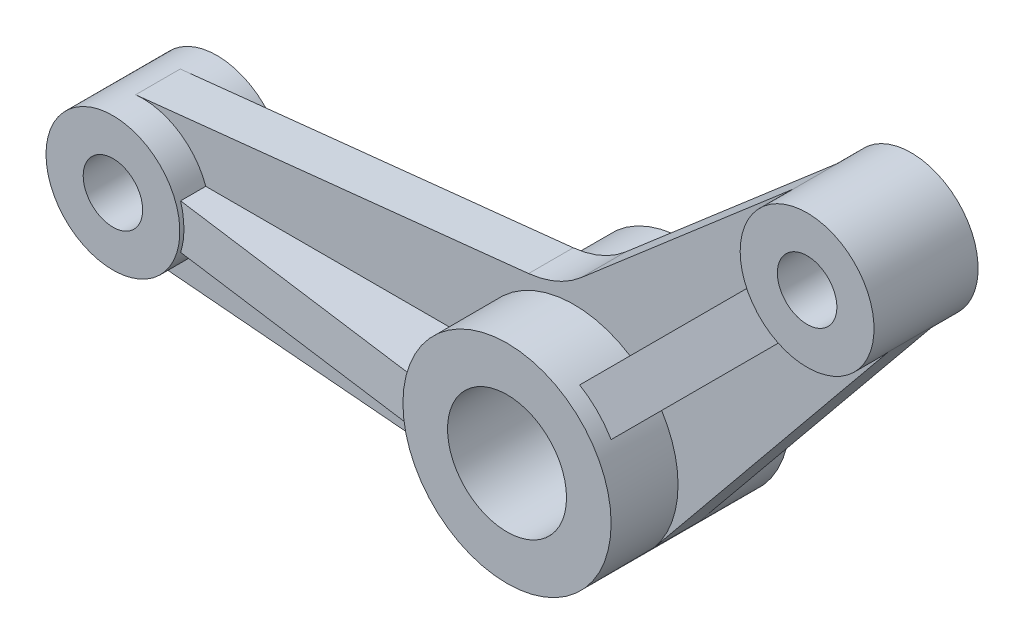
from build123d import *

# Parameters (mm, degrees)
SKETCH_1_R        = 4.5
SKETCH_1_R_2      = 2
EXTRUDE_1_DEPTH   = 3.5
EXTRUDE_1_2_DEPTH = 3.5
SKETCH_2_R        = 7
SKETCH_2_R_2      = 4
EXTRUDE_2_DEPTH   = 6
EXTRUDE_4_DEPTH   = 1.5
EXTRUDE_5_DEPTH   = 1.5
RIB_7_REACH       = 42.621
SKETCH_9_WALL_W   = 99.325216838
SKETCH_9_WALL_H   = 3


with BuildPart() as part:
    # Sketch 1 → Extrude 1 (new, symmetric)
    with BuildSketch(Plane.XY):
        with Locations(Location((-29, 0, 0), (0, 0, 180))):
            Circle(SKETCH_1_R)
        with Locations(Location((-29, 0, 0), (0, 0, 180))):
            Circle(SKETCH_1_R_2, mode=Mode.SUBTRACT)
    extrude(amount=EXTRUDE_1_DEPTH, both=True)



with BuildPart() as body_2:
    # Sketch 1 → Extrude 1 2 (new, symmetric)
    with BuildSketch(Plane.XY):
        with Locations(Location((17.67766953, 17.67766953, 0), (0, 0, 180))):
            Circle(SKETCH_1_R)
        with Locations(Location((17.67766953, 17.67766953, 0), (0, 0, 180))):
            Circle(SKETCH_1_R_2, mode=Mode.SUBTRACT)
    extrude(amount=EXTRUDE_1_2_DEPTH, both=True)


with BuildPart() as body_3:
    # Sketch 2 → Extrude 2 (new, symmetric)
    with BuildSketch(Plane.XY):
        Circle(SKETCH_2_R)
        Circle(SKETCH_2_R_2, mode=Mode.SUBTRACT)
    extrude(amount=EXTRUDE_2_DEPTH, both=True)


with BuildPart() as part_1:
    add(part.part)

    add(body_2.part)  # Extrude 4 merges body 2

    add(body_3.part)  # Extrude 4 merges body 3
    # Sketch 4 → Extrude 4 (add, symmetric)
    with BuildSketch(Plane.XY):
        with BuildLine():
            Line((-29.474382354, 4.474925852), (-3.048667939, 7.276289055))
            ThreePointArc((-3.048667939, 7.276289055), (-1.166919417, 7.770806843), (0.481815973, 8.803859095))
            Line((0.481815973, 8.803859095), (14.74066241, 21.087066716))
            ThreePointArc((14.74066241, 21.087066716), (14.537113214, 14.454797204), (21.161898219, 14.829836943))
            Line((21.161898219, 14.829836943), (5.419911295, -4.429961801))
            ThreePointArc((5.419911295, -4.429961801), (-2.723515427, 6.448446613), (-0.603448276, -6.973940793))
            Line((-0.603448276, -6.973940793), (-29.387931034, -4.483247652))
            ThreePointArc((-29.387931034, -4.483247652), (-24.500209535, 0.043425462), (-29.474382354, 4.474925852))
        make_face()
    extrude(amount=EXTRUDE_4_DEPTH, both=True)

    # Sketch 7 → Extrude 5 (add, symmetric)
    with BuildSketch(Plane(origin=(0, 0, 0), x_dir=(1, 0, 0), z_dir=(0, 1, 0))):
        Polygon((-25.289381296, 3.119926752), (-5.99402899, 5.708327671), (-5.99402899, -5.708327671), (-25.289381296, -3.119926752), align=None)
    extrude(amount=EXTRUDE_5_DEPTH, both=True)

    # Sketch 9 wall → Rib 7 (add, up to next)
    with BuildSketch(Plane(origin=(9.884486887, 9.884486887, 4), x_dir=(0.701617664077, 0.701617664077, -0.124359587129), z_dir=(-0.087935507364, -0.087935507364, -0.992237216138)), mode=Mode.PRIVATE) as rib_7_sk1:
        Rectangle(SKETCH_9_WALL_W, SKETCH_9_WALL_H)
    rib_7_tool1 = extrude(rib_7_sk1.sketch, amount=RIB_7_REACH, mode=Mode.PRIVATE) - part_1.part
    rib_7 = rib_7_tool1.solids().sort_by_distance((9.884486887, 9.884486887, 4))[0]
    add(rib_7)

    # Mirror 1: Rib 7 across plane
    add(rib_7.mirror(Plane.XY))


solid = part_1.part
